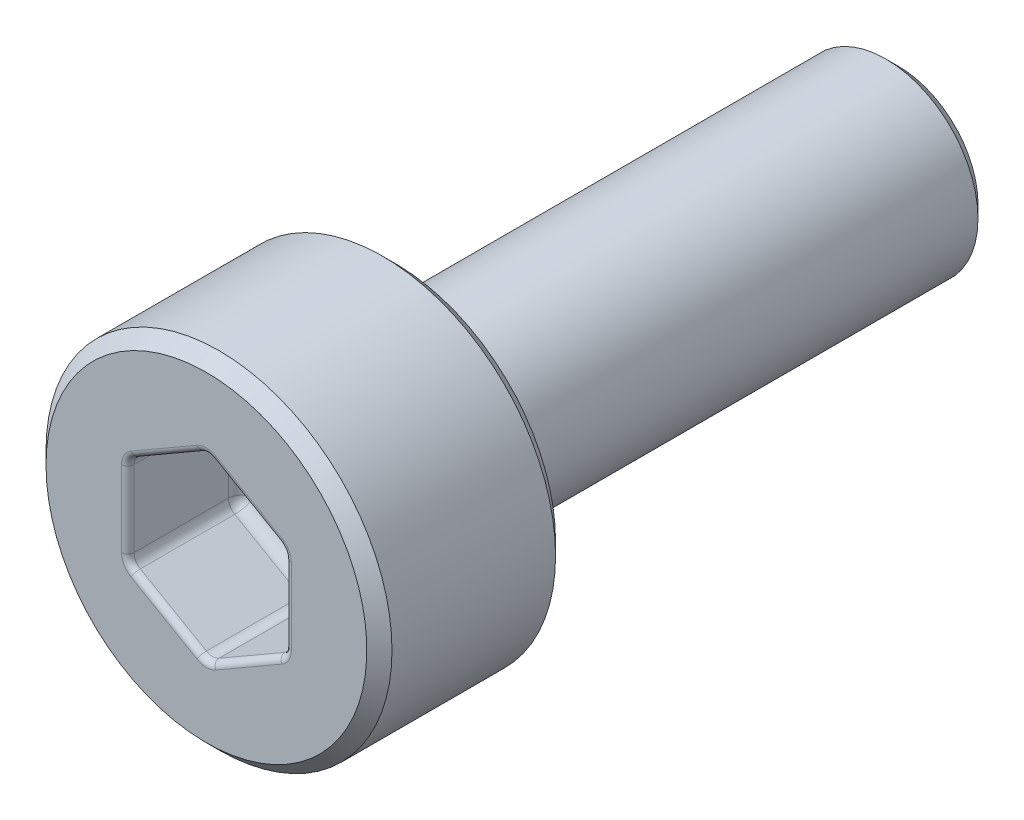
from build123d import *

# Parameters (mm, degrees)
SCHNITT_LINEAR_AUSTRAGEN1_DEPTH = 1.8
FASE1_SIZE                      = 0.2
VERRUNDUNG1_R                   = 0.2
VERRUNDUNG2_R                   = 0.1


with BuildPart() as part:
    # Skizze1 → Rotation1 (revolve)
    with BuildSketch(Plane(origin=(0, 0, 0), x_dir=(0, 0, -1), z_dir=(1, 0, 0)), mode=Mode.PRIVATE) as rotation1_sk:
        Polygon((-3, 0), (-3, 2.75), (0, 2.75), (0, 1.465), (8, 1.465), (8, 0), align=None)
    revolve(rotation1_sk.sketch.rotate(Axis((0, 0, 21.919879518), (0, 0, -1)), 90), axis=Axis((0, 0, 21.919879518), (0, 0, -1)))

    # Skizze2 → Schnitt-Linear austragen1 (cut)
    with BuildSketch(Plane.XY.offset(3)):
        Polygon((1.25, -0.721687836), (1.25, 0.721687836), (0, 1.443375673), (-1.25, 0.721687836), (-1.25, -0.721687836), (0, -1.443375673), align=None)
    extrude(amount=-SCHNITT_LINEAR_AUSTRAGEN1_DEPTH, mode=Mode.SUBTRACT)

    # Fase1
    fase1_edges = [part.edges().sort_by_distance(p)[0] for p in [
        (-1.465, 0, -8),
        (-2.75, 0, 0),
        (-2.75, 0, 3),
    ]]
    chamfer(fase1_edges, length=FASE1_SIZE)

    # Verrundung1
    verrundung1_edges = [part.edges().sort_by_distance(p)[0] for p in [
        (0.625, -1.082531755, 1.2),
        (1.25, -0.721687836, 2.1),
        (-0.625, -1.082531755, 1.2),
        (0, -1.443375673, 2.1),
        (-1.25, 0, 1.2),
        (-1.25, -0.721687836, 2.1),
        (-0.625, 1.082531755, 1.2),
        (-1.25, 0.721687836, 2.1),
        (0.625, 1.082531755, 1.2),
        (0, 1.443375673, 2.1),
        (1.25, 0, 1.2),
        (1.25, 0.721687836, 2.1),
        (-1.465, 0, 0),
    ]]
    fillet(verrundung1_edges, radius=VERRUNDUNG1_R)

    # Verrundung2
    verrundung2_edges = [part.edges().sort_by_distance(p)[0] for p in [
        (-0.625, -1.082531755, 3),
        (-1.25, 0, 3),
        (-0.625, 1.082531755, 3),
        (0.625, 1.082531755, 3),
        (1.25, 0, 3),
        (0.625, -1.082531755, 3),
        (-1.223205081, -0.706217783, 3),
        (0, -1.412435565, 3),
        (1.223205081, -0.706217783, 3),
        (1.223205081, 0.706217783, 3),
        (0, 1.412435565, 3),
        (-1.223205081, 0.706217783, 3),
    ]]
    fillet(verrundung2_edges, radius=VERRUNDUNG2_R)


solid = part.part
